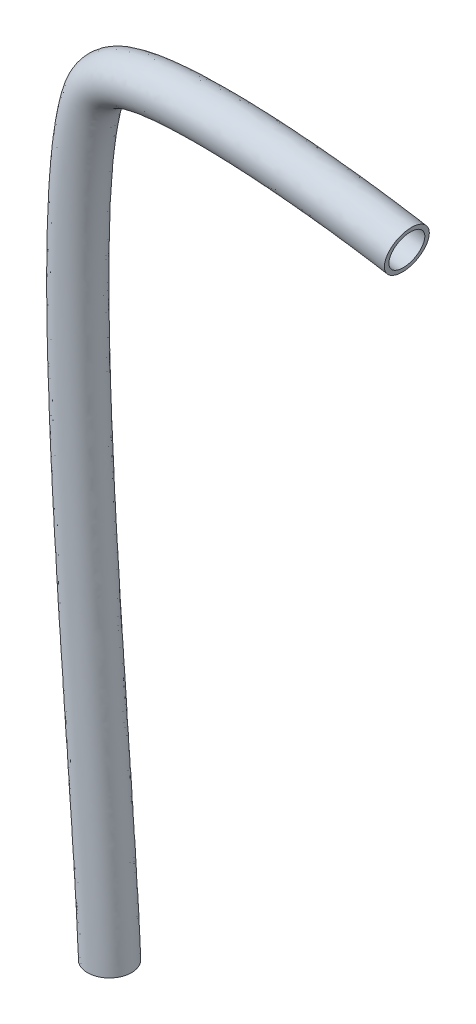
from build123d import *

# Parameters (mm, degrees)
CROQUIS4_R   = 5
CROQUIS4_R_2 = 4


with BuildPart() as part:
    # Barrer2: sweep along a path in Croquis5
    with BuildLine() as barrer2_path:  # in the path sketch's own coordinates; laid on its plane below (add() does not lay a ready-made edge on the line's plane)
        add(Edge.make_bspline(
            [(0, 0), (-1.358601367, 37.049447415), (-13.602095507, 147.081067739), (1.331018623, 180.483536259), (44.268581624, 177.294902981), (67.49, 173.36)],
            knots=[0, 0, 0, 0, 0.678477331, 0.778477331, 1, 1, 1, 1], degree=3))
    # Croquis4 → Barrer2 (sweep)
    with BuildSketch(Plane(origin=(0, 0, 0), x_dir=(1, 0, 0), z_dir=(0, 1, 0))):
        Circle(CROQUIS4_R)
        Circle(CROQUIS4_R_2, mode=Mode.SUBTRACT)
    sweep(path=Plane.XY * barrer2_path.line)


solid = part.part
